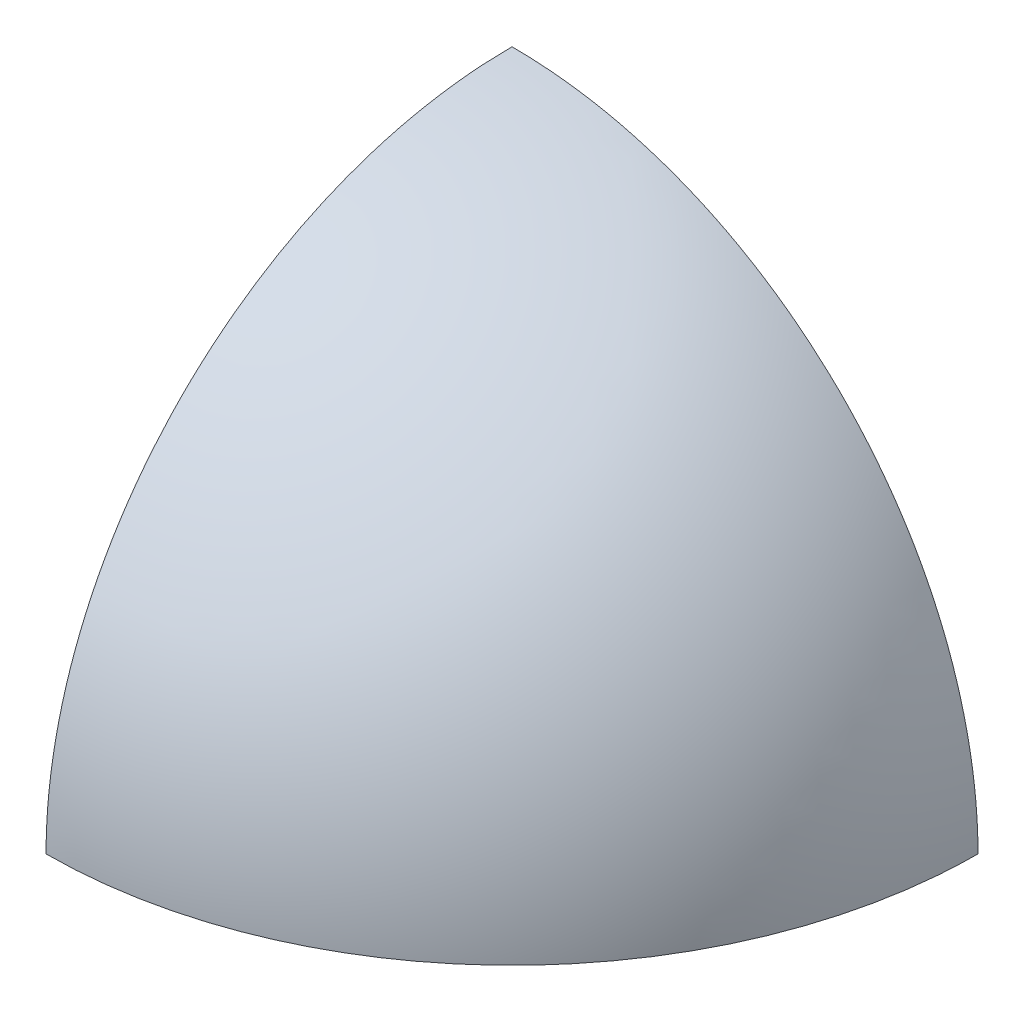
ISO-10303-21;
HEADER;
FILE_DESCRIPTION(('STEP AP214'),'2;1');
FILE_NAME('part.step','',(''),(''),'','','');
FILE_SCHEMA(('AUTOMOTIVE_DESIGN { 1 0 10303 214 1 1 1 1 }'));
ENDSEC;
DATA;
#1=APPLICATION_CONTEXT('core data for automotive mechanical design processes');
#2=APPLICATION_PROTOCOL_DEFINITION('international standard','automotive_design',2000,#1);
#3=PRODUCT_CONTEXT('',#1,'mechanical');
#4=PRODUCT('Part','Part','',(#3));
#5=PRODUCT_RELATED_PRODUCT_CATEGORY('part','',(#4));
#6=PRODUCT_DEFINITION_FORMATION('','',#4);
#7=PRODUCT_DEFINITION_CONTEXT('part definition',#1,'design');
#8=PRODUCT_DEFINITION('design','',#6,#7);
#9=PRODUCT_DEFINITION_SHAPE('','',#8);
#10=(LENGTH_UNIT() NAMED_UNIT(*) SI_UNIT(.MILLI.,.METRE.));
#11=(NAMED_UNIT(*) PLANE_ANGLE_UNIT() SI_UNIT($,.RADIAN.));
#12=(NAMED_UNIT(*) SI_UNIT($,.STERADIAN.) SOLID_ANGLE_UNIT());
#13=UNCERTAINTY_MEASURE_WITH_UNIT(LENGTH_MEASURE(1.E-05),#10,'distance_accuracy_value','');
#14=(GEOMETRIC_REPRESENTATION_CONTEXT(3) GLOBAL_UNCERTAINTY_ASSIGNED_CONTEXT((#13)) GLOBAL_UNIT_ASSIGNED_CONTEXT((#10,
#11,#12)) REPRESENTATION_CONTEXT('',''));
#15=CARTESIAN_POINT('',(0.,0.,0.));
#16=DIRECTION('',(0.,0.,1.));
#17=DIRECTION('',(1.,0.,0.));
#18=AXIS2_PLACEMENT_3D('',#15,#16,#17);
#19=CARTESIAN_POINT('',(1.62052041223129,1.62052041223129,1.62052041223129));
#20=DIRECTION('',(0.577350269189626,0.577350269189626,0.577350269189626));
#21=DIRECTION('',(0.,-0.707106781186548,0.707106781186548));
#22=AXIS2_PLACEMENT_3D('',#19,#20,#21);
#23=PLANE('',#22);
#24=CARTESIAN_POINT('',(1.62052041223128,1.62052041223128,1.62052041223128));
#25=DIRECTION('',(-0.577350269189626,-0.577350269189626,-0.577350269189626));
#26=DIRECTION('',(-0.707106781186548,0.,0.707106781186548));
#27=AXIS2_PLACEMENT_3D('',#24,#25,#26);
#28=CIRCLE('',#27,2.5);
#29=CARTESIAN_POINT('',(-0.147246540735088,1.62052041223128,3.38828736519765));
#30=VERTEX_POINT('',#29);
#31=EDGE_CURVE('E19',#30,#30,#28,.F.);
#32=ORIENTED_EDGE('',*,*,#31,.F.);
#33=EDGE_LOOP('',(#32));
#34=FACE_BOUND('',#33,.T.);
#35=ADVANCED_FACE('F16',(#34),#23,.F.);
#36=CARTESIAN_POINT('',(23.5598306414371,23.5598306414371,23.5598306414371));
#37=DIRECTION('',(-0.577350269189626,-0.577350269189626,-0.577350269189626));
#38=DIRECTION('',(-0.707106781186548,0.,0.707106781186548));
#39=AXIS2_PLACEMENT_3D('',#36,#37,#38);
#40=CYLINDRICAL_SURFACE('',#39,2.5);
#41=CARTESIAN_POINT('',(23.5598306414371,23.5598306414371,23.5598306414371));
#42=DIRECTION('',(-0.577350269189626,-0.577350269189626,-0.577350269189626));
#43=DIRECTION('',(-0.707106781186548,0.,0.707106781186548));
#44=AXIS2_PLACEMENT_3D('',#41,#42,#43);
#45=CIRCLE('',#44,2.5);
#46=CARTESIAN_POINT('',(21.7920636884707,23.5598306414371,25.3275975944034));
#47=VERTEX_POINT('',#46);
#48=EDGE_CURVE('E34',#47,#47,#45,.F.);
#49=ORIENTED_EDGE('',*,*,#48,.F.);
#50=EDGE_LOOP('',(#49));
#51=FACE_BOUND('',#50,.T.);
#52=ORIENTED_EDGE('',*,*,#31,.T.);
#53=EDGE_LOOP('',(#52));
#54=FACE_BOUND('',#53,.T.);
#55=ADVANCED_FACE('F143',(#51,#54),#40,.T.);
#56=CARTESIAN_POINT('',(23.5598306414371,23.5598306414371,23.5598306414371));
#57=DIRECTION('',(-0.577350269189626,-0.577350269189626,-0.577350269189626));
#58=DIRECTION('',(-0.707106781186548,0.,0.707106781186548));
#59=AXIS2_PLACEMENT_3D('',#56,#57,#58);
#60=PLANE('',#59);
#61=ORIENTED_EDGE('',*,*,#48,.T.);
#62=EDGE_LOOP('',(#61));
#63=FACE_BOUND('',#62,.T.);
#64=CARTESIAN_POINT('',(23.5598306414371,23.5598306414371,23.5598306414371));
#65=DIRECTION('',(-0.577350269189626,-0.577350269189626,-0.577350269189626));
#66=DIRECTION('',(-0.707106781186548,0.,0.707106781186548));
#67=AXIS2_PLACEMENT_3D('',#64,#65,#66);
#68=CIRCLE('',#67,4.);
#69=CARTESIAN_POINT('',(26.3882577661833,23.5598306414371,20.7314035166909));
#70=VERTEX_POINT('',#69);
#71=EDGE_CURVE('E136',#70,#70,#68,.F.);
#72=ORIENTED_EDGE('',*,*,#71,.F.);
#73=EDGE_LOOP('',(#72));
#74=FACE_BOUND('',#73,.T.);
#75=ADVANCED_FACE('F145',(#63,#74),#60,.T.);
#76=CARTESIAN_POINT('',(29.3333333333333,29.3333333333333,29.3333333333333));
#77=DIRECTION('',(-0.577350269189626,-0.577350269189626,-0.577350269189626));
#78=DIRECTION('',(-0.707106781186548,0.,0.707106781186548));
#79=AXIS2_PLACEMENT_3D('',#76,#77,#78);
#80=CYLINDRICAL_SURFACE('',#79,4.);
#81=ORIENTED_EDGE('',*,*,#71,.T.);
#82=EDGE_LOOP('',(#81));
#83=FACE_BOUND('',#82,.T.);
#84=CARTESIAN_POINT('',(50.7543101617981,50.7543101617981,50.7543101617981));
#85=DIRECTION('',(-0.577350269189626,-0.577350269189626,-0.577350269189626));
#86=DIRECTION('',(-0.707106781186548,0.,0.707106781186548));
#87=AXIS2_PLACEMENT_3D('',#84,#85,#86);
#88=CIRCLE('',#87,4.);
#89=CARTESIAN_POINT('',(53.5827372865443,50.7543101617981,47.9258830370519));
#90=VERTEX_POINT('',#89);
#91=EDGE_CURVE('E135',#90,#90,#88,.T.);
#92=ORIENTED_EDGE('',*,*,#91,.T.);
#93=EDGE_LOOP('',(#92));
#94=FACE_BOUND('',#93,.T.);
#95=ADVANCED_FACE('F115',(#83,#94),#80,.T.);
#96=CARTESIAN_POINT('',(0.,0.,0.));
#97=DIRECTION('',(-0.707106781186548,0.,0.707106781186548));
#98=DIRECTION('',(0.408248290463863,-0.816496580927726,0.408248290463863));
#99=AXIS2_PLACEMENT_3D('',#96,#97,#98);
#100=SPHERICAL_SURFACE('',#99,88.);
#101=CARTESIAN_POINT('',(0.,88.0000000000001,0.));
#102=CARTESIAN_POINT('',(1.23756224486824,88.0000166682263,0.));
#103=CARTESIAN_POINT('',(2.47512325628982,87.9738944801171,0.));
#104=CARTESIAN_POINT('',(4.9479922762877,87.8694942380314,0.));
#105=CARTESIAN_POINT('',(6.1833003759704,87.7912183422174,0.));
#106=CARTESIAN_POINT('',(8.64948630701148,87.582635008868,0.));
#107=CARTESIAN_POINT('',(9.88036424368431,87.4523288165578,0.));
#108=CARTESIAN_POINT('',(12.3355211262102,87.1399231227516,0.));
#109=CARTESIAN_POINT('',(13.5598001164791,86.957823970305,0.));
#110=CARTESIAN_POINT('',(15.9986765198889,86.5423099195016,0.));
#111=CARTESIAN_POINT('',(17.2132804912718,86.3089335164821,0.));
#112=CARTESIAN_POINT('',(19.6315618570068,85.7912047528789,0.));
#113=CARTESIAN_POINT('',(20.835239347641,85.5068528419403,0.));
#114=CARTESIAN_POINT('',(23.2295414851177,84.8876749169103,0.));
#115=CARTESIAN_POINT('',(24.4201662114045,84.5528492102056,0.));
#116=CARTESIAN_POINT('',(26.7862176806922,83.8333326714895,0.));
#117=CARTESIAN_POINT('',(27.9616444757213,83.4486420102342,0.));
#118=CARTESIAN_POINT('',(30.6849464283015,82.4933587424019,0.));
#119=CARTESIAN_POINT('',(32.2261359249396,81.9035821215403,0.));
#120=CARTESIAN_POINT('',(35.2729042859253,80.6383496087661,0.));
#121=CARTESIAN_POINT('',(36.7784826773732,79.9628925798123,0.));
#122=CARTESIAN_POINT('',(39.7493092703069,78.5284228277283,0.));
#123=CARTESIAN_POINT('',(41.2145574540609,77.7694100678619,0.));
#124=CARTESIAN_POINT('',(44.0998203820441,76.1703734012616,0.));
#125=CARTESIAN_POINT('',(45.5198431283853,75.3303639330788,0.));
#126=CARTESIAN_POINT('',(48.3104304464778,73.5718850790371,0.));
#127=CARTESIAN_POINT('',(49.6809951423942,72.6534158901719,0.));
#128=CARTESIAN_POINT('',(52.368371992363,70.7408889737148,0.));
#129=CARTESIAN_POINT('',(53.6851843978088,69.7468315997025,0.));
#130=CARTESIAN_POINT('',(55.9388216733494,67.9439348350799,0.));
#131=CARTESIAN_POINT('',(56.8883462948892,67.1509154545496,0.));
#132=CARTESIAN_POINT('',(58.7531540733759,65.5255458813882,0.));
#133=CARTESIAN_POINT('',(59.6684350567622,64.6931931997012,0.));
#134=CARTESIAN_POINT('',(62.3602584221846,62.1394695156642,0.));
#135=CARTESIAN_POINT('',(64.0832628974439,60.3610474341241,0.));
#136=CARTESIAN_POINT('',(67.3736178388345,56.6649689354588,0.));
#137=CARTESIAN_POINT('',(68.9409369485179,54.7472846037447,0.));
#138=CARTESIAN_POINT('',(71.1662894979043,51.777323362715,0.));
#139=CARTESIAN_POINT('',(71.8872145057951,50.771638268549,0.));
#140=CARTESIAN_POINT('',(73.2860118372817,48.7307956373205,0.));
#141=CARTESIAN_POINT('',(73.9638868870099,47.6956399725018,0.));
#142=CARTESIAN_POINT('',(75.4941450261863,45.2477129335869,0.));
#143=CARTESIAN_POINT('',(76.3293247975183,43.8241469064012,0.));
#144=CARTESIAN_POINT('',(77.9183350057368,40.9323244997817,0.));
#145=CARTESIAN_POINT('',(78.6721638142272,39.4640672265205,0.));
#146=CARTESIAN_POINT('',(80.0961420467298,36.4873978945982,0.));
#147=CARTESIAN_POINT('',(80.7662862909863,34.9789833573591,0.));
#148=CARTESIAN_POINT('',(82.0203964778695,31.9276374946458,0.));
#149=CARTESIAN_POINT('',(82.6044059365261,30.3847240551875,0.));
#150=CARTESIAN_POINT('',(83.6847688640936,27.2686396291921,0.));
#151=CARTESIAN_POINT('',(84.1811280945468,25.6954706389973,0.));
#152=CARTESIAN_POINT('',(85.0845690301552,22.5240666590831,0.));
#153=CARTESIAN_POINT('',(85.4916734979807,20.9258381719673,0.));
#154=CARTESIAN_POINT('',(86.091283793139,18.2609986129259,0.));
#155=CARTESIAN_POINT('',(86.309498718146,17.2000972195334,0.));
#156=CARTESIAN_POINT('',(86.706591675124,15.0711355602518,0.));
#157=CARTESIAN_POINT('',(86.8854771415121,14.0030766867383,0.));
#158=CARTESIAN_POINT('',(87.2036941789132,11.8611926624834,0.));
#159=CARTESIAN_POINT('',(87.343029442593,10.7873680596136,0.));
#160=CARTESIAN_POINT('',(87.5818121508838,8.63683838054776,0.));
#161=CARTESIAN_POINT('',(87.6813160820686,7.56013957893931,0.));
#162=CARTESIAN_POINT('',(87.8405877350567,5.40370554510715,0.));
#163=CARTESIAN_POINT('',(87.9003517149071,4.32397003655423,0.));
#164=CARTESIAN_POINT('',(87.9800664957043,2.16282349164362,0.));
#165=CARTESIAN_POINT('',(88.000009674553,1.08141217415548,0.));
#166=CARTESIAN_POINT('',(88.,0.,0.));
#167=B_SPLINE_CURVE_WITH_KNOTS('',3,(#101,#102,#103,#104,#105,#106,#107,#108,#109,#110,#111,
#112,#113,#114,#115,#116,#117,#118,#119,#120,#121,#122,#123,#124,#125,#126,#127,#128,#129,#130,
#131,#132,#133,#134,#135,#136,#137,#138,#139,#140,#141,#142,#143,#144,#145,#146,#147,#148,#149,
#150,#151,#152,#153,#154,#155,#156,#157,#158,#159,#160,#161,#162,#163,#164,#165,#166),
.UNSPECIFIED.,.F.,.F.,(4,2,2,2,2,2,2,2,2,2,2,2,2,2,2,2,2,2,2,2,2,2,2,2,2,2,2,2,2,2,2,2,4),(0.,
3.71240931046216,7.42466500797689,11.136831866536,14.8489737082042,18.5583382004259,
22.267669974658,25.9769791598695,29.6862756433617,34.6340951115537,39.5819802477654,
44.5298675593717,49.476874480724,54.4238689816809,59.3708403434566,63.0811335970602,
66.7916619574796,74.2108739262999,81.6315771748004,85.342814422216,89.0538164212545,
94.0025306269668,98.9513438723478,103.900463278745,108.847073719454,113.793358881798,
118.738381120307,121.987046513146,125.235097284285,128.482844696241,131.725969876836,
134.969400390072,138.213451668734),.UNSPECIFIED.);
#168=CARTESIAN_POINT('',(0.,88.,0.));
#169=VERTEX_POINT('',#168);
#170=CARTESIAN_POINT('',(88.,0.,0.));
#171=VERTEX_POINT('',#170);
#172=EDGE_CURVE('E72',#169,#171,#167,.T.);
#173=ORIENTED_EDGE('',*,*,#172,.T.);
#174=CARTESIAN_POINT('',(88.,0.,0.));
#175=CARTESIAN_POINT('',(88.0000166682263,0.,1.23756224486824));
#176=CARTESIAN_POINT('',(87.9738944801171,0.,2.47512325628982));
#177=CARTESIAN_POINT('',(87.8694942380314,0.,4.94799227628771));
#178=CARTESIAN_POINT('',(87.7912183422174,0.,6.18330037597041));
#179=CARTESIAN_POINT('',(87.582635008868,0.,8.64948630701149));
#180=CARTESIAN_POINT('',(87.4523288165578,0.,9.88036424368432));
#181=CARTESIAN_POINT('',(87.1399231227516,0.,12.3355211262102));
#182=CARTESIAN_POINT('',(86.957823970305,0.,13.5598001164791));
#183=CARTESIAN_POINT('',(86.5423099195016,0.,15.9986765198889));
#184=CARTESIAN_POINT('',(86.3089335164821,0.,17.2132804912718));
#185=CARTESIAN_POINT('',(85.7912047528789,0.,19.6315618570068));
#186=CARTESIAN_POINT('',(85.5068528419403,0.,20.835239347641));
#187=CARTESIAN_POINT('',(84.8876749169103,0.,23.2295414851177));
#188=CARTESIAN_POINT('',(84.5528492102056,0.,24.4201662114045));
#189=CARTESIAN_POINT('',(83.8333326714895,0.,26.7862176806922));
#190=CARTESIAN_POINT('',(83.4486420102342,0.,27.9616444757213));
#191=CARTESIAN_POINT('',(82.4933587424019,0.,30.6849464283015));
#192=CARTESIAN_POINT('',(81.9035821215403,0.,32.2261359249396));
#193=CARTESIAN_POINT('',(80.6383496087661,0.,35.2729042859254));
#194=CARTESIAN_POINT('',(79.9628925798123,0.,36.7784826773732));
#195=CARTESIAN_POINT('',(78.5284228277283,0.,39.7493092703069));
#196=CARTESIAN_POINT('',(77.7694100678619,0.,41.2145574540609));
#197=CARTESIAN_POINT('',(76.1703734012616,0.,44.0998203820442));
#198=CARTESIAN_POINT('',(75.3303639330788,0.,45.5198431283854));
#199=CARTESIAN_POINT('',(73.571885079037,0.,48.3104304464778));
#200=CARTESIAN_POINT('',(72.6534158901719,0.,49.6809951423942));
#201=CARTESIAN_POINT('',(70.7408889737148,0.,52.3683719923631));
#202=CARTESIAN_POINT('',(69.7468315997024,0.,53.6851843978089));
#203=CARTESIAN_POINT('',(67.9439348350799,0.,55.9388216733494));
#204=CARTESIAN_POINT('',(67.1509154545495,0.,56.8883462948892));
#205=CARTESIAN_POINT('',(65.5255458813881,0.,58.753154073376));
#206=CARTESIAN_POINT('',(64.6931931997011,0.,59.6684350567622));
#207=CARTESIAN_POINT('',(62.1394695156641,0.,62.3602584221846));
#208=CARTESIAN_POINT('',(60.361047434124,0.,64.083262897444));
#209=CARTESIAN_POINT('',(56.6649689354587,0.,67.3736178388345));
#210=CARTESIAN_POINT('',(54.7472846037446,0.,68.9409369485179));
#211=CARTESIAN_POINT('',(51.7773233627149,0.,71.1662894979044));
#212=CARTESIAN_POINT('',(50.771638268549,0.,71.8872145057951));
#213=CARTESIAN_POINT('',(48.7307956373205,0.,73.2860118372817));
#214=CARTESIAN_POINT('',(47.6956399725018,0.,73.96388688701));
#215=CARTESIAN_POINT('',(45.2477129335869,0.,75.4941450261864));
#216=CARTESIAN_POINT('',(43.8241469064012,0.,76.3293247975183));
#217=CARTESIAN_POINT('',(40.9323244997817,0.,77.9183350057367));
#218=CARTESIAN_POINT('',(39.4640672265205,0.,78.6721638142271));
#219=CARTESIAN_POINT('',(36.4873978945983,0.,80.0961420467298));
#220=CARTESIAN_POINT('',(34.9789833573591,0.,80.7662862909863));
#221=CARTESIAN_POINT('',(31.9276374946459,0.,82.0203964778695));
#222=CARTESIAN_POINT('',(30.3847240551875,0.,82.604405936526));
#223=CARTESIAN_POINT('',(27.2686396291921,0.,83.6847688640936));
#224=CARTESIAN_POINT('',(25.6954706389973,0.,84.1811280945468));
#225=CARTESIAN_POINT('',(22.5240666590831,0.,85.0845690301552));
#226=CARTESIAN_POINT('',(20.9258381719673,0.,85.4916734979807));
#227=CARTESIAN_POINT('',(18.260998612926,0.,86.0912837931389));
#228=CARTESIAN_POINT('',(17.2000972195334,0.,86.309498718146));
#229=CARTESIAN_POINT('',(15.0711355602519,0.,86.706591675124));
#230=CARTESIAN_POINT('',(14.0030766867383,0.,86.8854771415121));
#231=CARTESIAN_POINT('',(11.8611926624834,0.,87.2036941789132));
#232=CARTESIAN_POINT('',(10.7873680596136,0.,87.343029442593));
#233=CARTESIAN_POINT('',(8.63683838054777,0.,87.5818121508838));
#234=CARTESIAN_POINT('',(7.56013957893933,0.,87.6813160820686));
#235=CARTESIAN_POINT('',(5.40370554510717,0.,87.8405877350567));
#236=CARTESIAN_POINT('',(4.32397003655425,0.,87.9003517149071));
#237=CARTESIAN_POINT('',(2.16282349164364,0.,87.9800664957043));
#238=CARTESIAN_POINT('',(1.0814121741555,0.,88.000009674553));
#239=CARTESIAN_POINT('',(0.,0.,88.));
#240=B_SPLINE_CURVE_WITH_KNOTS('',3,(#174,#175,#176,#177,#178,#179,#180,#181,#182,#183,#184,
#185,#186,#187,#188,#189,#190,#191,#192,#193,#194,#195,#196,#197,#198,#199,#200,#201,#202,#203,
#204,#205,#206,#207,#208,#209,#210,#211,#212,#213,#214,#215,#216,#217,#218,#219,#220,#221,#222,
#223,#224,#225,#226,#227,#228,#229,#230,#231,#232,#233,#234,#235,#236,#237,#238,#239),
.UNSPECIFIED.,.F.,.F.,(4,2,2,2,2,2,2,2,2,2,2,2,2,2,2,2,2,2,2,2,2,2,2,2,2,2,2,2,2,2,2,2,4),(0.,
3.71240931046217,7.42466500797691,11.136831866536,14.8489737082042,18.5583382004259,
22.267669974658,25.9769791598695,29.6862756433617,34.6340951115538,39.5819802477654,
44.5298675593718,49.4768744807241,54.4238689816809,59.3708403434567,63.0811335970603,
66.7916619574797,74.2108739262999,81.6315771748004,85.342814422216,89.0538164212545,
94.0025306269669,98.9513438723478,103.900463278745,108.847073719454,113.793358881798,
118.738381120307,121.987046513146,125.235097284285,128.482844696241,131.725969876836,
134.969400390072,138.213451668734),.UNSPECIFIED.);
#241=CARTESIAN_POINT('',(0.,0.,88.));
#242=VERTEX_POINT('',#241);
#243=EDGE_CURVE('E68',#171,#242,#240,.T.);
#244=ORIENTED_EDGE('',*,*,#243,.T.);
#245=CARTESIAN_POINT('',(0.,0.,88.));
#246=CARTESIAN_POINT('',(0.,1.23756224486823,88.0000166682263));
#247=CARTESIAN_POINT('',(0.,2.47512325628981,87.9738944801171));
#248=CARTESIAN_POINT('',(0.,4.9479922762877,87.8694942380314));
#249=CARTESIAN_POINT('',(0.,6.1833003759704,87.7912183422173));
#250=CARTESIAN_POINT('',(0.,8.64948630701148,87.582635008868));
#251=CARTESIAN_POINT('',(0.,9.88036424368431,87.4523288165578));
#252=CARTESIAN_POINT('',(0.,12.3355211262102,87.1399231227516));
#253=CARTESIAN_POINT('',(0.,13.5598001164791,86.957823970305));
#254=CARTESIAN_POINT('',(0.,15.9986765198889,86.5423099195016));
#255=CARTESIAN_POINT('',(0.,17.2132804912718,86.3089335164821));
#256=CARTESIAN_POINT('',(0.,19.6315618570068,85.7912047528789));
#257=CARTESIAN_POINT('',(0.,20.835239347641,85.5068528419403));
#258=CARTESIAN_POINT('',(0.,23.2295414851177,84.8876749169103));
#259=CARTESIAN_POINT('',(0.,24.4201662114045,84.5528492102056));
#260=CARTESIAN_POINT('',(0.,26.7862176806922,83.8333326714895));
#261=CARTESIAN_POINT('',(0.,27.9616444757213,83.4486420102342));
#262=CARTESIAN_POINT('',(0.,30.6849464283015,82.4933587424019));
#263=CARTESIAN_POINT('',(0.,32.2261359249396,81.9035821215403));
#264=CARTESIAN_POINT('',(0.,35.2729042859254,80.6383496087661));
#265=CARTESIAN_POINT('',(0.,36.7784826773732,79.9628925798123));
#266=CARTESIAN_POINT('',(0.,39.7493092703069,78.5284228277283));
#267=CARTESIAN_POINT('',(0.,41.2145574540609,77.7694100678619));
#268=CARTESIAN_POINT('',(0.,44.0998203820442,76.1703734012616));
#269=CARTESIAN_POINT('',(0.,45.5198431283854,75.3303639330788));
#270=CARTESIAN_POINT('',(0.,48.3104304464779,73.571885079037));
#271=CARTESIAN_POINT('',(0.,49.6809951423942,72.6534158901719));
#272=CARTESIAN_POINT('',(0.,52.3683719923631,70.7408889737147));
#273=CARTESIAN_POINT('',(0.,53.6851843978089,69.7468315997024));
#274=CARTESIAN_POINT('',(0.,55.9388216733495,67.9439348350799));
#275=CARTESIAN_POINT('',(0.,56.8883462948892,67.1509154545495));
#276=CARTESIAN_POINT('',(0.,58.753154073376,65.5255458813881));
#277=CARTESIAN_POINT('',(0.,59.6684350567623,64.6931931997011));
#278=CARTESIAN_POINT('',(0.,62.3602584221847,62.1394695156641));
#279=CARTESIAN_POINT('',(0.,64.083262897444,60.361047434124));
#280=CARTESIAN_POINT('',(0.,67.3736178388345,56.6649689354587));
#281=CARTESIAN_POINT('',(0.,68.9409369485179,54.7472846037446));
#282=CARTESIAN_POINT('',(0.,71.1662894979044,51.7773233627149));
#283=CARTESIAN_POINT('',(0.,71.8872145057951,50.771638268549));
#284=CARTESIAN_POINT('',(0.,73.2860118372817,48.7307956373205));
#285=CARTESIAN_POINT('',(0.,73.96388688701,47.6956399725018));
#286=CARTESIAN_POINT('',(0.,75.4941450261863,45.2477129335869));
#287=CARTESIAN_POINT('',(0.,76.3293247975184,43.8241469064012));
#288=CARTESIAN_POINT('',(0.,77.9183350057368,40.9323244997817));
#289=CARTESIAN_POINT('',(0.,78.6721638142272,39.4640672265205));
#290=CARTESIAN_POINT('',(0.,80.0961420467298,36.4873978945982));
#291=CARTESIAN_POINT('',(0.,80.7662862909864,34.9789833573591));
#292=CARTESIAN_POINT('',(0.,82.0203964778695,31.9276374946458));
#293=CARTESIAN_POINT('',(0.,82.6044059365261,30.3847240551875));
#294=CARTESIAN_POINT('',(0.,83.6847688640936,27.268639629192));
#295=CARTESIAN_POINT('',(0.,84.1811280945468,25.6954706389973));
#296=CARTESIAN_POINT('',(0.,85.0845690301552,22.5240666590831));
#297=CARTESIAN_POINT('',(0.,85.4916734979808,20.9258381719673));
#298=CARTESIAN_POINT('',(0.,86.091283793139,18.2609986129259));
#299=CARTESIAN_POINT('',(0.,86.309498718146,17.2000972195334));
#300=CARTESIAN_POINT('',(0.,86.706591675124,15.0711355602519));
#301=CARTESIAN_POINT('',(0.,86.8854771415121,14.0030766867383));
#302=CARTESIAN_POINT('',(0.,87.2036941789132,11.8611926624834));
#303=CARTESIAN_POINT('',(0.,87.343029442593,10.7873680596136));
#304=CARTESIAN_POINT('',(0.,87.5818121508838,8.63683838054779));
#305=CARTESIAN_POINT('',(0.,87.6813160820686,7.56013957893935));
#306=CARTESIAN_POINT('',(0.,87.8405877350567,5.4037055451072));
#307=CARTESIAN_POINT('',(0.,87.9003517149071,4.32397003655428));
#308=CARTESIAN_POINT('',(0.,87.9800664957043,2.16282349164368));
#309=CARTESIAN_POINT('',(0.,88.000009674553,1.08141217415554));
#310=CARTESIAN_POINT('',(0.,88.0000000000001,0.));
#311=B_SPLINE_CURVE_WITH_KNOTS('',3,(#245,#246,#247,#248,#249,#250,#251,#252,#253,#254,#255,
#256,#257,#258,#259,#260,#261,#262,#263,#264,#265,#266,#267,#268,#269,#270,#271,#272,#273,#274,
#275,#276,#277,#278,#279,#280,#281,#282,#283,#284,#285,#286,#287,#288,#289,#290,#291,#292,#293,
#294,#295,#296,#297,#298,#299,#300,#301,#302,#303,#304,#305,#306,#307,#308,#309,#310),
.UNSPECIFIED.,.F.,.F.,(4,2,2,2,2,2,2,2,2,2,2,2,2,2,2,2,2,2,2,2,2,2,2,2,2,2,2,2,2,2,2,2,4),(0.,
3.71240931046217,7.42466500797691,11.136831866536,14.8489737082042,18.5583382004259,
22.267669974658,25.9769791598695,29.6862756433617,34.6340951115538,39.5819802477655,
44.5298675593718,49.4768744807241,54.423868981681,59.3708403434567,63.0811335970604,
66.7916619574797,74.2108739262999,81.6315771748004,85.342814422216,89.0538164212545,
94.0025306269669,98.9513438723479,103.900463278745,108.847073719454,113.793358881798,
118.738381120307,121.987046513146,125.235097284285,128.482844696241,131.725969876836,
134.969400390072,138.213451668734),.UNSPECIFIED.);
#312=EDGE_CURVE('E122',#242,#169,#311,.T.);
#313=ORIENTED_EDGE('',*,*,#312,.T.);
#314=EDGE_LOOP('',(#173,#244,#313));
#315=FACE_BOUND('',#314,.T.);
#316=ORIENTED_EDGE('',*,*,#91,.F.);
#317=EDGE_LOOP('',(#316));
#318=FACE_BOUND('',#317,.T.);
#319=ADVANCED_FACE('F110',(#315,#318),#100,.F.);
#320=CARTESIAN_POINT('',(0.,0.,0.));
#321=DIRECTION('',(1.,0.,0.));
#322=DIRECTION('',(0.,0.,-1.));
#323=AXIS2_PLACEMENT_3D('',#320,#321,#322);
#324=PLANE('',#323);
#325=CARTESIAN_POINT('',(0.,90.,0.));
#326=CARTESIAN_POINT('',(0.,90.0000170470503,1.26568865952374));
#327=CARTESIAN_POINT('',(0.,89.9733011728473,2.53137605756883));
#328=CARTESIAN_POINT('',(0.,89.8665281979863,5.06044664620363));
#329=CARTESIAN_POINT('',(0.,89.7864733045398,6.32382992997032));
#330=CARTESIAN_POINT('',(0.,89.5731494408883,8.84606554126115));
#331=CARTESIAN_POINT('',(0.,89.4398817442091,10.1049179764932));
#332=CARTESIAN_POINT('',(0.,89.1203759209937,12.6158738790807));
#333=CARTESIAN_POINT('',(0.,88.9341381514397,13.8679773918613));
#334=CARTESIAN_POINT('',(0.,88.5091805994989,16.3622828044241));
#335=CARTESIAN_POINT('',(0.,88.2705001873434,17.6044914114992));
#336=CARTESIAN_POINT('',(0.,87.7410048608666,20.0777337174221));
#337=CARTESIAN_POINT('',(0.,87.4501904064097,21.3087675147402));
#338=CARTESIAN_POINT('',(0.,86.8169402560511,23.7574856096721));
#339=CARTESIAN_POINT('',(0.,86.4745048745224,24.9751699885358));
#340=CARTESIAN_POINT('',(0.,85.7386356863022,27.394995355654));
#341=CARTESIAN_POINT('',(0.,85.3452020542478,28.5971363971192));
#342=CARTESIAN_POINT('',(0.,84.3682078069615,31.3823315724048));
#343=CARTESIAN_POINT('',(0.,83.7650271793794,32.9585480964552));
#344=CARTESIAN_POINT('',(0.,82.4710393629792,36.0745612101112));
#345=CARTESIAN_POINT('',(0.,81.7802310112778,37.6143573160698));
#346=CARTESIAN_POINT('',(0.,80.3131597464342,40.6527026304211));
#347=CARTESIAN_POINT('',(0.,79.5368967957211,42.1512518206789));
#348=CARTESIAN_POINT('',(0.,77.9015181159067,45.1020891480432));
#349=CARTESIAN_POINT('',(0.,77.0424171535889,46.5543854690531));
#350=CARTESIAN_POINT('',(0.,75.2439738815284,49.4083943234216));
#351=CARTESIAN_POINT('',(0.,74.3046317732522,50.8101069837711));
#352=CARTESIAN_POINT('',(0.,72.3486345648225,53.5585639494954));
#353=CARTESIAN_POINT('',(0.,71.331979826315,54.9053085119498));
#354=CARTESIAN_POINT('',(0.,69.4881204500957,57.210153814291));
#355=CARTESIAN_POINT('',(0.,68.6770900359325,58.1812477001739));
#356=CARTESIAN_POINT('',(0.,67.0147454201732,60.0884685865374));
#357=CARTESIAN_POINT('',(0.,66.1634286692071,61.0245933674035));
#358=CARTESIAN_POINT('',(0.,64.4221660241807,62.8600402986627));
#359=CARTESIAN_POINT('',(0.,63.5322233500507,63.7593655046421));
#360=CARTESIAN_POINT('',(0.,61.7151159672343,65.5198052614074));
#361=CARTESIAN_POINT('',(0.,60.7879470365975,66.3809154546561));
#362=CARTESIAN_POINT('',(0.,58.8979413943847,68.0634526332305));
#363=CARTESIAN_POINT('',(0.,57.9350975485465,68.8848716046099));
#364=CARTESIAN_POINT('',(0.,55.9757438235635,70.4862883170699));
#365=CARTESIAN_POINT('',(0.,54.9792377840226,71.2662907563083));
#366=CARTESIAN_POINT('',(0.,52.954145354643,72.7836478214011));
#367=CARTESIAN_POINT('',(0.,51.9255566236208,73.5209993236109));
#368=CARTESIAN_POINT('',(0.,49.8382962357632,74.9516185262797));
#369=CARTESIAN_POINT('',(0.,48.779626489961,75.6448890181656));
#370=CARTESIAN_POINT('',(0.,46.2760771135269,77.2099147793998));
#371=CARTESIAN_POINT('',(0.,44.8201521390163,78.0640804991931));
#372=CARTESIAN_POINT('',(0.,41.8626027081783,79.6892079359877));
#373=CARTESIAN_POINT('',(0.,40.3609773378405,80.4601679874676));
#374=CARTESIAN_POINT('',(0.,37.3166574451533,81.9165084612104));
#375=CARTESIAN_POINT('',(0.,35.7739603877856,82.6018835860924));
#376=CARTESIAN_POINT('',(0.,32.653265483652,83.884496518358));
#377=CARTESIAN_POINT('',(0.,31.0752859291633,84.4817788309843));
#378=CARTESIAN_POINT('',(0.,27.8883814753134,85.5866953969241));
#379=CARTESIAN_POINT('',(0.,26.2794586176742,86.0943355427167));
#380=CARTESIAN_POINT('',(0.,23.0359772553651,87.018309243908));
#381=CARTESIAN_POINT('',(0.,21.4014254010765,87.4346660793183));
#382=CARTESIAN_POINT('',(0.,18.6760213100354,88.0479038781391));
#383=CARTESIAN_POINT('',(0.,17.591008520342,88.271078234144));
#384=CARTESIAN_POINT('',(0.,15.4136613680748,88.6771960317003));
#385=CARTESIAN_POINT('',(0.,14.321328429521,88.8601470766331));
#386=CARTESIAN_POINT('',(0.,12.1307652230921,89.1855963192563));
#387=CARTESIAN_POINT('',(0.,11.0325355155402,89.3280982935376));
#388=CARTESIAN_POINT('',(0.,8.83313016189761,89.572307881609));
#389=CARTESIAN_POINT('',(0.,7.73196093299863,89.6740732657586));
#390=CARTESIAN_POINT('',(0.,5.52651703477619,89.8369647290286));
#391=CARTESIAN_POINT('',(0.,4.42224208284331,89.8980869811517));
#392=CARTESIAN_POINT('',(0.,2.21197857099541,89.9796134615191));
#393=CARTESIAN_POINT('',(0.,1.1059897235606,90.0000098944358));
#394=CARTESIAN_POINT('',(0.,0.,90.));
#395=B_SPLINE_CURVE_WITH_KNOTS('',3,(#325,#326,#327,#328,#329,#330,#331,#332,#333,#334,#335,
#336,#337,#338,#339,#340,#341,#342,#343,#344,#345,#346,#347,#348,#349,#350,#351,#352,#353,#354,
#355,#356,#357,#358,#359,#360,#361,#362,#363,#364,#365,#366,#367,#368,#369,#370,#371,#372,#373,
#374,#375,#376,#377,#378,#379,#380,#381,#382,#383,#384,#385,#386,#387,#388,#389,#390,#391,#392,
#393,#394),.UNSPECIFIED.,.F.,.F.,(4,2,2,2,2,2,2,2,2,2,2,2,2,2,2,2,2,2,2,2,2,2,2,2,2,2,2,2,2,2,2,
2,2,2,4),(0.,3.7967822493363,7.59340739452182,11.3899416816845,15.1864503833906,
18.9801186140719,22.7737533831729,26.5673650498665,30.3609637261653,35.4212336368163,
40.4815707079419,45.5419100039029,50.6013489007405,55.6607750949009,60.7201776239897,
64.5147957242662,68.3096542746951,72.1041970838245,75.8991714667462,79.6949089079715,
83.4902148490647,87.2857983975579,91.08114135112,96.1423263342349,101.20361260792,
106.265212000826,111.324245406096,116.382946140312,121.440355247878,124.7628539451,
128.084724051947,131.406283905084,134.723116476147,138.040261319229,141.358041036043),.UNSPECIFIED.);
#396=CARTESIAN_POINT('',(0.,90.,0.));
#397=VERTEX_POINT('',#396);
#398=CARTESIAN_POINT('',(0.,0.,90.));
#399=VERTEX_POINT('',#398);
#400=EDGE_CURVE('E79',#397,#399,#395,.T.);
#401=ORIENTED_EDGE('',*,*,#400,.F.);
#402=DIRECTION('',(0.,1.,0.));
#403=VECTOR('',#402,1.);
#404=CARTESIAN_POINT('',(0.,0.,0.));
#405=LINE('',#404,#403);
#406=EDGE_CURVE('E71',#397,#169,#405,.F.);
#407=ORIENTED_EDGE('',*,*,#406,.T.);
#408=ORIENTED_EDGE('',*,*,#312,.F.);
#409=DIRECTION('',(0.,0.,1.));
#410=VECTOR('',#409,1.);
#411=CARTESIAN_POINT('',(0.,0.,0.));
#412=LINE('',#411,#410);
#413=EDGE_CURVE('E107',#242,#399,#412,.T.);
#414=ORIENTED_EDGE('',*,*,#413,.T.);
#415=EDGE_LOOP('',(#401,#407,#408,#414));
#416=FACE_BOUND('',#415,.T.);
#417=ADVANCED_FACE('F114',(#416),#324,.F.);
#418=CARTESIAN_POINT('',(0.,0.,0.));
#419=DIRECTION('',(0.,1.,0.));
#420=DIRECTION('',(0.,0.,1.));
#421=AXIS2_PLACEMENT_3D('',#418,#419,#420);
#422=PLANE('',#421);
#423=ORIENTED_EDGE('',*,*,#243,.F.);
#424=DIRECTION('',(1.,0.,0.));
#425=VECTOR('',#424,1.);
#426=CARTESIAN_POINT('',(0.,0.,0.));
#427=LINE('',#426,#425);
#428=CARTESIAN_POINT('',(90.,0.,0.));
#429=VERTEX_POINT('',#428);
#430=EDGE_CURVE('E62',#171,#429,#427,.T.);
#431=ORIENTED_EDGE('',*,*,#430,.T.);
#432=CARTESIAN_POINT('',(0.,0.,90.));
#433=CARTESIAN_POINT('',(1.26568865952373,0.,90.0000170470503));
#434=CARTESIAN_POINT('',(2.53137605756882,0.,89.9733011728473));
#435=CARTESIAN_POINT('',(5.06044664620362,0.,89.8665281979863));
#436=CARTESIAN_POINT('',(6.32382992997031,0.,89.7864733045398));
#437=CARTESIAN_POINT('',(8.84606554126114,0.,89.5731494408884));
#438=CARTESIAN_POINT('',(10.1049179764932,0.,89.4398817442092));
#439=CARTESIAN_POINT('',(12.6158738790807,0.,89.1203759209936));
#440=CARTESIAN_POINT('',(13.8679773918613,0.,88.9341381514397));
#441=CARTESIAN_POINT('',(16.3622828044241,0.,88.5091805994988));
#442=CARTESIAN_POINT('',(17.6044914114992,0.,88.2705001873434));
#443=CARTESIAN_POINT('',(20.0777337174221,0.,87.7410048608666));
#444=CARTESIAN_POINT('',(21.3087675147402,0.,87.4501904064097));
#445=CARTESIAN_POINT('',(23.7574856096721,0.,86.8169402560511));
#446=CARTESIAN_POINT('',(24.9751699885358,0.,86.4745048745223));
#447=CARTESIAN_POINT('',(27.394995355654,0.,85.7386356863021));
#448=CARTESIAN_POINT('',(28.5971363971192,0.,85.3452020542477));
#449=CARTESIAN_POINT('',(31.3823315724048,0.,84.3682078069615));
#450=CARTESIAN_POINT('',(32.9585480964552,0.,83.7650271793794));
#451=CARTESIAN_POINT('',(36.0745612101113,0.,82.4710393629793));
#452=CARTESIAN_POINT('',(37.6143573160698,0.,81.7802310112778));
#453=CARTESIAN_POINT('',(40.6527026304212,0.,80.3131597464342));
#454=CARTESIAN_POINT('',(42.151251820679,0.,79.536896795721));
#455=CARTESIAN_POINT('',(45.1020891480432,0.,77.9015181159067));
#456=CARTESIAN_POINT('',(46.5543854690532,0.,77.0424171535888));
#457=CARTESIAN_POINT('',(49.4083943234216,0.,75.2439738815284));
#458=CARTESIAN_POINT('',(50.8101069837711,0.,74.3046317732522));
#459=CARTESIAN_POINT('',(53.5585639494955,0.,72.3486345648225));
#460=CARTESIAN_POINT('',(54.9053085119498,0.,71.3319798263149));
#461=CARTESIAN_POINT('',(57.2101538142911,0.,69.4881204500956));
#462=CARTESIAN_POINT('',(58.181247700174,0.,68.6770900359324));
#463=CARTESIAN_POINT('',(60.0884685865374,0.,67.0147454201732));
#464=CARTESIAN_POINT('',(61.0245933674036,0.,66.1634286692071));
#465=CARTESIAN_POINT('',(62.8600402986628,0.,64.4221660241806));
#466=CARTESIAN_POINT('',(63.7593655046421,0.,63.5322233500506));
#467=CARTESIAN_POINT('',(65.5198052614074,0.,61.7151159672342));
#468=CARTESIAN_POINT('',(66.3809154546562,0.,60.7879470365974));
#469=CARTESIAN_POINT('',(68.0634526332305,0.,58.8979413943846));
#470=CARTESIAN_POINT('',(68.8848716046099,0.,57.9350975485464));
#471=CARTESIAN_POINT('',(70.4862883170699,0.,55.9757438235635));
#472=CARTESIAN_POINT('',(71.2662907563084,0.,54.9792377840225));
#473=CARTESIAN_POINT('',(72.7836478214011,0.,52.954145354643));
#474=CARTESIAN_POINT('',(73.5209993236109,0.,51.9255566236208));
#475=CARTESIAN_POINT('',(74.9516185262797,0.,49.8382962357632));
#476=CARTESIAN_POINT('',(75.6448890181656,0.,48.779626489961));
#477=CARTESIAN_POINT('',(77.2099147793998,0.,46.2760771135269));
#478=CARTESIAN_POINT('',(78.0640804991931,0.,44.8201521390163));
#479=CARTESIAN_POINT('',(79.6892079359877,0.,41.8626027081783));
#480=CARTESIAN_POINT('',(80.4601679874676,0.,40.3609773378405));
#481=CARTESIAN_POINT('',(81.9165084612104,0.,37.3166574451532));
#482=CARTESIAN_POINT('',(82.6018835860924,0.,35.7739603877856));
#483=CARTESIAN_POINT('',(83.8844965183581,0.,32.653265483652));
#484=CARTESIAN_POINT('',(84.4817788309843,0.,31.0752859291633));
#485=CARTESIAN_POINT('',(85.5866953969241,0.,27.8883814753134));
#486=CARTESIAN_POINT('',(86.0943355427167,0.,26.2794586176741));
#487=CARTESIAN_POINT('',(87.018309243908,0.,23.0359772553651));
#488=CARTESIAN_POINT('',(87.4346660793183,0.,21.4014254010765));
#489=CARTESIAN_POINT('',(88.0479038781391,0.,18.6760213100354));
#490=CARTESIAN_POINT('',(88.271078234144,0.,17.591008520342));
#491=CARTESIAN_POINT('',(88.6771960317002,0.,15.4136613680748));
#492=CARTESIAN_POINT('',(88.8601470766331,0.,14.321328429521));
#493=CARTESIAN_POINT('',(89.1855963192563,0.,12.1307652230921));
#494=CARTESIAN_POINT('',(89.3280982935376,0.,11.0325355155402));
#495=CARTESIAN_POINT('',(89.572307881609,0.,8.83313016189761));
#496=CARTESIAN_POINT('',(89.6740732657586,0.,7.73196093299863));
#497=CARTESIAN_POINT('',(89.8369647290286,0.,5.52651703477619));
#498=CARTESIAN_POINT('',(89.8980869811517,0.,4.42224208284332));
#499=CARTESIAN_POINT('',(89.979613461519,0.,2.21197857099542));
#500=CARTESIAN_POINT('',(90.0000098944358,0.,1.10598972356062));
#501=CARTESIAN_POINT('',(90.,0.,0.));
#502=B_SPLINE_CURVE_WITH_KNOTS('',3,(#432,#433,#434,#435,#436,#437,#438,#439,#440,#441,#442,
#443,#444,#445,#446,#447,#448,#449,#450,#451,#452,#453,#454,#455,#456,#457,#458,#459,#460,#461,
#462,#463,#464,#465,#466,#467,#468,#469,#470,#471,#472,#473,#474,#475,#476,#477,#478,#479,#480,
#481,#482,#483,#484,#485,#486,#487,#488,#489,#490,#491,#492,#493,#494,#495,#496,#497,#498,#499,
#500,#501),.UNSPECIFIED.,.F.,.F.,(4,2,2,2,2,2,2,2,2,2,2,2,2,2,2,2,2,2,2,2,2,2,2,2,2,2,2,2,2,2,2,
2,2,2,4),(0.,3.79678224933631,7.59340739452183,11.3899416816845,15.1864503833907,
18.9801186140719,22.773753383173,26.5673650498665,30.3609637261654,35.4212336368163,
40.4815707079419,45.5419100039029,50.6013489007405,55.6607750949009,60.7201776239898,
64.5147957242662,68.3096542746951,72.1041970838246,75.8991714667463,79.6949089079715,
83.4902148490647,87.2857983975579,91.08114135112,96.142326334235,101.20361260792,
106.265212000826,111.324245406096,116.382946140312,121.440355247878,124.7628539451,
128.084724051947,131.406283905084,134.723116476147,138.040261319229,141.358041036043),.UNSPECIFIED.);
#503=EDGE_CURVE('E24',#399,#429,#502,.T.);
#504=ORIENTED_EDGE('',*,*,#503,.F.);
#505=ORIENTED_EDGE('',*,*,#413,.F.);
#506=EDGE_LOOP('',(#423,#431,#504,#505));
#507=FACE_BOUND('',#506,.T.);
#508=ADVANCED_FACE('F64',(#507),#422,.F.);
#509=CARTESIAN_POINT('',(0.,0.,0.));
#510=DIRECTION('',(0.,0.,1.));
#511=DIRECTION('',(1.,0.,0.));
#512=AXIS2_PLACEMENT_3D('',#509,#510,#511);
#513=PLANE('',#512);
#514=CARTESIAN_POINT('',(90.,0.,0.));
#515=CARTESIAN_POINT('',(90.0000170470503,1.26568865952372,0.));
#516=CARTESIAN_POINT('',(89.9733011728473,2.53137605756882,0.));
#517=CARTESIAN_POINT('',(89.8665281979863,5.06044664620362,0.));
#518=CARTESIAN_POINT('',(89.7864733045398,6.32382992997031,0.));
#519=CARTESIAN_POINT('',(89.5731494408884,8.84606554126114,0.));
#520=CARTESIAN_POINT('',(89.4398817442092,10.1049179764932,0.));
#521=CARTESIAN_POINT('',(89.1203759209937,12.6158738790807,0.));
#522=CARTESIAN_POINT('',(88.9341381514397,13.8679773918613,0.));
#523=CARTESIAN_POINT('',(88.5091805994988,16.3622828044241,0.));
#524=CARTESIAN_POINT('',(88.2705001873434,17.6044914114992,0.));
#525=CARTESIAN_POINT('',(87.7410048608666,20.0777337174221,0.));
#526=CARTESIAN_POINT('',(87.4501904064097,21.3087675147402,0.));
#527=CARTESIAN_POINT('',(86.8169402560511,23.7574856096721,0.));
#528=CARTESIAN_POINT('',(86.4745048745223,24.9751699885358,0.));
#529=CARTESIAN_POINT('',(85.7386356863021,27.394995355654,0.));
#530=CARTESIAN_POINT('',(85.3452020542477,28.5971363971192,0.));
#531=CARTESIAN_POINT('',(84.3682078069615,31.3823315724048,0.));
#532=CARTESIAN_POINT('',(83.7650271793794,32.9585480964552,0.));
#533=CARTESIAN_POINT('',(82.4710393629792,36.0745612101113,0.));
#534=CARTESIAN_POINT('',(81.7802310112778,37.6143573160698,0.));
#535=CARTESIAN_POINT('',(80.3131597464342,40.6527026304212,0.));
#536=CARTESIAN_POINT('',(79.536896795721,42.151251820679,0.));
#537=CARTESIAN_POINT('',(77.9015181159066,45.1020891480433,0.));
#538=CARTESIAN_POINT('',(77.0424171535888,46.5543854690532,0.));
#539=CARTESIAN_POINT('',(75.2439738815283,49.4083943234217,0.));
#540=CARTESIAN_POINT('',(74.3046317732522,50.8101069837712,0.));
#541=CARTESIAN_POINT('',(72.3486345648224,53.5585639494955,0.));
#542=CARTESIAN_POINT('',(71.3319798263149,54.9053085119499,0.));
#543=CARTESIAN_POINT('',(69.4881204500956,57.2101538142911,0.));
#544=CARTESIAN_POINT('',(68.6770900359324,58.181247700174,0.));
#545=CARTESIAN_POINT('',(67.0147454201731,60.0884685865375,0.));
#546=CARTESIAN_POINT('',(66.1634286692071,61.0245933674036,0.));
#547=CARTESIAN_POINT('',(64.4221660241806,62.8600402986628,0.));
#548=CARTESIAN_POINT('',(63.5322233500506,63.7593655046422,0.));
#549=CARTESIAN_POINT('',(61.7151159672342,65.5198052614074,0.));
#550=CARTESIAN_POINT('',(60.7879470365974,66.3809154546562,0.));
#551=CARTESIAN_POINT('',(58.8979413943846,68.0634526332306,0.));
#552=CARTESIAN_POINT('',(57.9350975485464,68.8848716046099,0.));
#553=CARTESIAN_POINT('',(55.9757438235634,70.48628831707,0.));
#554=CARTESIAN_POINT('',(54.9792377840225,71.2662907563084,0.));
#555=CARTESIAN_POINT('',(52.9541453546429,72.7836478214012,0.));
#556=CARTESIAN_POINT('',(51.9255566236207,73.520999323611,0.));
#557=CARTESIAN_POINT('',(49.8382962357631,74.9516185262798,0.));
#558=CARTESIAN_POINT('',(48.779626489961,75.6448890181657,0.));
#559=CARTESIAN_POINT('',(46.2760771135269,77.2099147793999,0.));
#560=CARTESIAN_POINT('',(44.8201521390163,78.0640804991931,0.));
#561=CARTESIAN_POINT('',(41.8626027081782,79.6892079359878,0.));
#562=CARTESIAN_POINT('',(40.3609773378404,80.4601679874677,0.));
#563=CARTESIAN_POINT('',(37.3166574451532,81.9165084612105,0.));
#564=CARTESIAN_POINT('',(35.7739603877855,82.6018835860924,0.));
#565=CARTESIAN_POINT('',(32.6532654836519,83.8844965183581,0.));
#566=CARTESIAN_POINT('',(31.0752859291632,84.4817788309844,0.));
#567=CARTESIAN_POINT('',(27.8883814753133,85.5866953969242,0.));
#568=CARTESIAN_POINT('',(26.279458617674,86.0943355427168,0.));
#569=CARTESIAN_POINT('',(23.035977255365,87.0183092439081,0.));
#570=CARTESIAN_POINT('',(21.4014254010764,87.4346660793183,0.));
#571=CARTESIAN_POINT('',(18.6760213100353,88.0479038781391,0.));
#572=CARTESIAN_POINT('',(17.5910085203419,88.271078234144,0.));
#573=CARTESIAN_POINT('',(15.4136613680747,88.6771960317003,0.));
#574=CARTESIAN_POINT('',(14.3213284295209,88.8601470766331,0.));
#575=CARTESIAN_POINT('',(12.130765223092,89.1855963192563,0.));
#576=CARTESIAN_POINT('',(11.0325355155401,89.3280982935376,0.));
#577=CARTESIAN_POINT('',(8.83313016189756,89.572307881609,0.));
#578=CARTESIAN_POINT('',(7.73196093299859,89.6740732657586,0.));
#579=CARTESIAN_POINT('',(5.52651703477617,89.8369647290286,0.));
#580=CARTESIAN_POINT('',(4.4222420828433,89.8980869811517,0.));
#581=CARTESIAN_POINT('',(2.21197857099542,89.9796134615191,0.));
#582=CARTESIAN_POINT('',(1.10598972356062,90.0000098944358,0.));
#583=CARTESIAN_POINT('',(0.,90.,0.));
#584=B_SPLINE_CURVE_WITH_KNOTS('',3,(#514,#515,#516,#517,#518,#519,#520,#521,#522,#523,#524,
#525,#526,#527,#528,#529,#530,#531,#532,#533,#534,#535,#536,#537,#538,#539,#540,#541,#542,#543,
#544,#545,#546,#547,#548,#549,#550,#551,#552,#553,#554,#555,#556,#557,#558,#559,#560,#561,#562,
#563,#564,#565,#566,#567,#568,#569,#570,#571,#572,#573,#574,#575,#576,#577,#578,#579,#580,#581,
#582,#583),.UNSPECIFIED.,.F.,.F.,(4,2,2,2,2,2,2,2,2,2,2,2,2,2,2,2,2,2,2,2,2,2,2,2,2,2,2,2,2,2,2,
2,2,2,4),(0.,3.79678224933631,7.59340739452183,11.3899416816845,15.1864503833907,
18.9801186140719,22.773753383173,26.5673650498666,30.3609637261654,35.4212336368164,
40.481570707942,45.541910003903,50.6013489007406,55.660775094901,60.7201776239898,
64.5147957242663,68.3096542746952,72.1041970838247,75.8991714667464,79.6949089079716,
83.4902148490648,87.285798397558,91.0811413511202,96.1423263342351,101.20361260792,
106.265212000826,111.324245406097,116.382946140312,121.440355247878,124.7628539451,
128.084724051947,131.406283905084,134.723116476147,138.040261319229,141.358041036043),.UNSPECIFIED.);
#585=EDGE_CURVE('E10',#429,#397,#584,.T.);
#586=ORIENTED_EDGE('',*,*,#585,.F.);
#587=ORIENTED_EDGE('',*,*,#430,.F.);
#588=ORIENTED_EDGE('',*,*,#172,.F.);
#589=ORIENTED_EDGE('',*,*,#406,.F.);
#590=EDGE_LOOP('',(#586,#587,#588,#589));
#591=FACE_BOUND('',#590,.T.);
#592=ADVANCED_FACE('F75',(#591),#513,.F.);
#593=CARTESIAN_POINT('',(0.,0.,0.));
#594=DIRECTION('',(-0.707106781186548,0.,0.707106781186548));
#595=DIRECTION('',(0.408248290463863,-0.816496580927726,0.408248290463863));
#596=AXIS2_PLACEMENT_3D('',#593,#594,#595);
#597=SPHERICAL_SURFACE('',#596,90.);
#598=ORIENTED_EDGE('',*,*,#503,.T.);
#599=ORIENTED_EDGE('',*,*,#585,.T.);
#600=ORIENTED_EDGE('',*,*,#400,.T.);
#601=EDGE_LOOP('',(#598,#599,#600));
#602=FACE_BOUND('',#601,.T.);
#603=ADVANCED_FACE('F78',(#602),#597,.T.);
#604=CLOSED_SHELL('',(#35,#55,#75,#95,#319,#417,#508,#592,#603));
#605=MANIFOLD_SOLID_BREP('B1',#604);
#606=ADVANCED_BREP_SHAPE_REPRESENTATION('',(#18,#605),#14);
#607=SHAPE_DEFINITION_REPRESENTATION(#9,#606);
ENDSEC;
END-ISO-10303-21;
